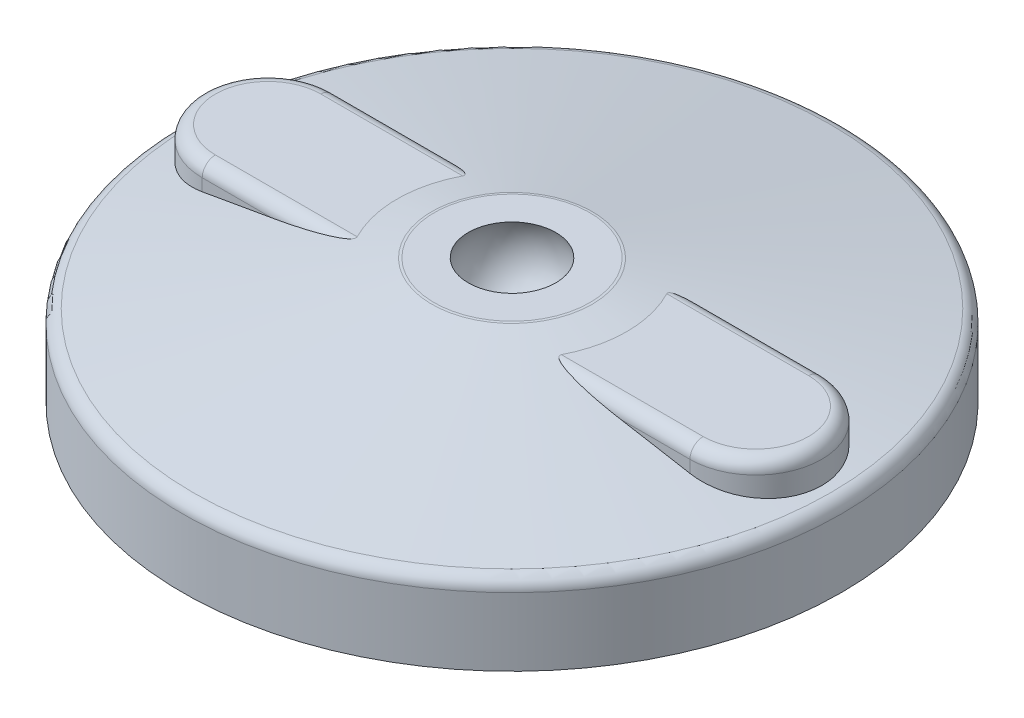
ISO-10303-21;
HEADER;
FILE_DESCRIPTION(('STEP AP214'),'2;1');
FILE_NAME('part.step','',(''),(''),'','','');
FILE_SCHEMA(('AUTOMOTIVE_DESIGN { 1 0 10303 214 1 1 1 1 }'));
ENDSEC;
DATA;
#1=APPLICATION_CONTEXT('core data for automotive mechanical design processes');
#2=APPLICATION_PROTOCOL_DEFINITION('international standard','automotive_design',2000,#1);
#3=PRODUCT_CONTEXT('',#1,'mechanical');
#4=PRODUCT('Part','Part','',(#3));
#5=PRODUCT_RELATED_PRODUCT_CATEGORY('part','',(#4));
#6=PRODUCT_DEFINITION_FORMATION('','',#4);
#7=PRODUCT_DEFINITION_CONTEXT('part definition',#1,'design');
#8=PRODUCT_DEFINITION('design','',#6,#7);
#9=PRODUCT_DEFINITION_SHAPE('','',#8);
#10=(LENGTH_UNIT() NAMED_UNIT(*) SI_UNIT(.MILLI.,.METRE.));
#11=(NAMED_UNIT(*) PLANE_ANGLE_UNIT() SI_UNIT($,.RADIAN.));
#12=(NAMED_UNIT(*) SI_UNIT($,.STERADIAN.) SOLID_ANGLE_UNIT());
#13=UNCERTAINTY_MEASURE_WITH_UNIT(LENGTH_MEASURE(1.E-05),#10,'distance_accuracy_value','');
#14=(GEOMETRIC_REPRESENTATION_CONTEXT(3) GLOBAL_UNCERTAINTY_ASSIGNED_CONTEXT((#13)) GLOBAL_UNIT_ASSIGNED_CONTEXT((#10,
#11,#12)) REPRESENTATION_CONTEXT('',''));
#15=CARTESIAN_POINT('',(0.,0.,0.));
#16=DIRECTION('',(0.,0.,1.));
#17=DIRECTION('',(1.,0.,0.));
#18=AXIS2_PLACEMENT_3D('',#15,#16,#17);
#19=CARTESIAN_POINT('',(0.,15.5,0.));
#20=DIRECTION('',(0.,0.,1.));
#21=DIRECTION('',(1.,0.,0.));
#22=AXIS2_PLACEMENT_3D('',#19,#20,#21);
#23=SPHERICAL_SURFACE('',#22,7.5);
#24=CARTESIAN_POINT('',(0.,15.5,0.));
#25=DIRECTION('',(0.,1.,0.));
#26=DIRECTION('',(0.,0.,1.));
#27=AXIS2_PLACEMENT_3D('',#24,#25,#26);
#28=SPHERICAL_SURFACE('',#27,7.5);
#29=CARTESIAN_POINT('',(0.,19.,0.));
#30=DIRECTION('',(0.,1.,0.));
#31=DIRECTION('',(0.,0.,1.));
#32=AXIS2_PLACEMENT_3D('',#29,#30,#31);
#33=CIRCLE('',#32,6.6332495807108);
#34=CARTESIAN_POINT('',(0.,19.,6.6332495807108));
#35=VERTEX_POINT('',#34);
#36=EDGE_CURVE('E19',#35,#35,#33,.F.);
#37=ORIENTED_EDGE('',*,*,#36,.F.);
#38=EDGE_LOOP('',(#37));
#39=FACE_BOUND('',#38,.T.);
#40=ADVANCED_FACE('F16',(#39),#28,.F.);
#41=CARTESIAN_POINT('',(37.,16.,0.));
#42=DIRECTION('',(0.,-1.,0.));
#43=DIRECTION('',(0.,0.,-1.));
#44=AXIS2_PLACEMENT_3D('',#41,#42,#43);
#45=TOROIDAL_SURFACE('',#44,8.,2.);
#46=CARTESIAN_POINT('',(37.,16.,8.));
#47=DIRECTION('',(-1.,0.,0.));
#48=DIRECTION('',(0.,-1.,0.));
#49=AXIS2_PLACEMENT_3D('',#46,#47,#48);
#50=CIRCLE('',#49,2.);
#51=CARTESIAN_POINT('',(37.,16.,10.));
#52=VERTEX_POINT('',#51);
#53=CARTESIAN_POINT('',(37.,18.,8.));
#54=VERTEX_POINT('',#53);
#55=EDGE_CURVE('E129',#52,#54,#50,.T.);
#56=ORIENTED_EDGE('',*,*,#55,.F.);
#57=CARTESIAN_POINT('',(37.,16.,0.));
#58=DIRECTION('',(0.,1.,0.));
#59=DIRECTION('',(-1.,0.,0.));
#60=AXIS2_PLACEMENT_3D('',#57,#58,#59);
#61=CIRCLE('',#60,10.);
#62=CARTESIAN_POINT('',(37.,16.,-10.));
#63=VERTEX_POINT('',#62);
#64=EDGE_CURVE('E103',#63,#52,#61,.F.);
#65=ORIENTED_EDGE('',*,*,#64,.F.);
#66=CARTESIAN_POINT('',(37.,16.,-8.));
#67=DIRECTION('',(1.,0.,0.));
#68=DIRECTION('',(0.,1.,0.));
#69=AXIS2_PLACEMENT_3D('',#66,#67,#68);
#70=CIRCLE('',#69,2.);
#71=CARTESIAN_POINT('',(37.,18.,-8.));
#72=VERTEX_POINT('',#71);
#73=EDGE_CURVE('E117',#72,#63,#70,.F.);
#74=ORIENTED_EDGE('',*,*,#73,.F.);
#75=CARTESIAN_POINT('',(37.,18.,0.));
#76=DIRECTION('',(0.,-1.,0.));
#77=DIRECTION('',(0.,0.,-1.));
#78=AXIS2_PLACEMENT_3D('',#75,#76,#77);
#79=CIRCLE('',#78,8.);
#80=EDGE_CURVE('E328',#54,#72,#79,.F.);
#81=ORIENTED_EDGE('',*,*,#80,.F.);
#82=EDGE_LOOP('',(#56,#65,#74,#81));
#83=FACE_BOUND('',#82,.T.);
#84=ADVANCED_FACE('F128',(#83),#45,.T.);
#85=CARTESIAN_POINT('',(-37.,16.,0.));
#86=DIRECTION('',(0.,-1.,0.));
#87=DIRECTION('',(0.,0.,-1.));
#88=AXIS2_PLACEMENT_3D('',#85,#86,#87);
#89=TOROIDAL_SURFACE('',#88,8.,2.);
#90=CARTESIAN_POINT('',(-37.,16.,7.99999999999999));
#91=DIRECTION('',(-1.,0.,0.));
#92=DIRECTION('',(0.,0.,1.));
#93=AXIS2_PLACEMENT_3D('',#90,#91,#92);
#94=CIRCLE('',#93,2.);
#95=CARTESIAN_POINT('',(-37.,18.,7.99999999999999));
#96=VERTEX_POINT('',#95);
#97=CARTESIAN_POINT('',(-37.,16.,10.));
#98=VERTEX_POINT('',#97);
#99=EDGE_CURVE('E272',#96,#98,#94,.F.);
#100=ORIENTED_EDGE('',*,*,#99,.F.);
#101=CARTESIAN_POINT('',(-37.,18.,0.));
#102=DIRECTION('',(0.,-1.,0.));
#103=DIRECTION('',(0.,0.,1.));
#104=AXIS2_PLACEMENT_3D('',#101,#102,#103);
#105=CIRCLE('',#104,7.99999999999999);
#106=CARTESIAN_POINT('',(-37.,18.,-8.));
#107=VERTEX_POINT('',#106);
#108=EDGE_CURVE('E80',#107,#96,#105,.F.);
#109=ORIENTED_EDGE('',*,*,#108,.F.);
#110=CARTESIAN_POINT('',(-37.,16.,-8.));
#111=DIRECTION('',(1.,0.,0.));
#112=DIRECTION('',(0.,1.,0.));
#113=AXIS2_PLACEMENT_3D('',#110,#111,#112);
#114=CIRCLE('',#113,2.);
#115=CARTESIAN_POINT('',(-37.,16.,-10.));
#116=VERTEX_POINT('',#115);
#117=EDGE_CURVE('E368',#116,#107,#114,.T.);
#118=ORIENTED_EDGE('',*,*,#117,.F.);
#119=CARTESIAN_POINT('',(-37.,16.,0.));
#120=DIRECTION('',(0.,1.,0.));
#121=DIRECTION('',(-1.,0.,0.));
#122=AXIS2_PLACEMENT_3D('',#119,#120,#121);
#123=CIRCLE('',#122,10.);
#124=EDGE_CURVE('E116',#98,#116,#123,.F.);
#125=ORIENTED_EDGE('',*,*,#124,.F.);
#126=EDGE_LOOP('',(#100,#109,#118,#125));
#127=FACE_BOUND('',#126,.T.);
#128=ADVANCED_FACE('F359',(#127),#89,.T.);
#129=CARTESIAN_POINT('',(9.2252879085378,19.,0.));
#130=DIRECTION('',(0.,1.,0.));
#131=DIRECTION('',(0.,0.,1.));
#132=AXIS2_PLACEMENT_3D('',#129,#130,#131);
#133=PLANE('',#132);
#134=ORIENTED_EDGE('',*,*,#36,.T.);
#135=EDGE_LOOP('',(#134));
#136=FACE_BOUND('',#135,.T.);
#137=CARTESIAN_POINT('',(0.,19.,0.));
#138=DIRECTION('',(0.,-1.,0.));
#139=DIRECTION('',(1.,0.,0.));
#140=AXIS2_PLACEMENT_3D('',#137,#138,#139);
#141=CIRCLE('',#140,11.8173262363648);
#142=CARTESIAN_POINT('',(11.8173262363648,19.,0.));
#143=VERTEX_POINT('',#142);
#144=EDGE_CURVE('E259',#143,#143,#141,.T.);
#145=ORIENTED_EDGE('',*,*,#144,.F.);
#146=EDGE_LOOP('',(#145));
#147=FACE_BOUND('',#146,.T.);
#148=ADVANCED_FACE('F253',(#136,#147),#133,.T.);
#149=CARTESIAN_POINT('',(12.,5.,-10.));
#150=DIRECTION('',(0.,0.,-1.));
#151=DIRECTION('',(-1.,0.,0.));
#152=AXIS2_PLACEMENT_3D('',#149,#150,#151);
#153=PLANE('',#152);
#154=DIRECTION('',(0.,1.,0.));
#155=VECTOR('',#154,1.);
#156=CARTESIAN_POINT('',(37.,5.,-10.));
#157=LINE('',#156,#155);
#158=CARTESIAN_POINT('',(36.999999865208,14.1501907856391,-10.));
#159=VERTEX_POINT('',#158);
#160=EDGE_CURVE('E107',#159,#63,#157,.T.);
#161=ORIENTED_EDGE('',*,*,#160,.F.);
#162=CARTESIAN_POINT('',(26.459055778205,16.0000000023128,-9.99999999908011));
#163=CARTESIAN_POINT('',(27.337937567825,15.8485359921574,-9.99999999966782));
#164=CARTESIAN_POINT('',(28.2166677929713,15.6961960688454,-9.99999999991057));
#165=CARTESIAN_POINT('',(29.9738775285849,15.3900854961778,-10.0000000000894));
#166=CARTESIAN_POINT('',(30.852357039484,15.2363148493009,-10.0000000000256));
#167=CARTESIAN_POINT('',(32.6091201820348,14.9276635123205,-9.99999999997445));
#168=CARTESIAN_POINT('',(33.4874038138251,14.7727828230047,-9.99999999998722));
#169=CARTESIAN_POINT('',(35.2438123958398,14.4621152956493,-10.0000000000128));
#170=CARTESIAN_POINT('',(36.1219373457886,14.3063284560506,-10.0000000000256));
#171=CARTESIAN_POINT('',(36.999999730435,14.1501908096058,-10.));
#172=B_SPLINE_CURVE_WITH_KNOTS('',3,(#162,#163,#164,#165,#166,#167,#168,#169,#170,#171),
.UNSPECIFIED.,.F.,.F.,(4,2,2,2,4),(0.,2.67551190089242,5.35101916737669,8.02652453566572,
10.7020345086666),.UNSPECIFIED.);
#173=CARTESIAN_POINT('',(26.4590557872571,16.,-10.));
#174=VERTEX_POINT('',#173);
#175=EDGE_CURVE('E115',#174,#159,#172,.T.);
#176=ORIENTED_EDGE('',*,*,#175,.F.);
#177=DIRECTION('',(1.,0.,0.));
#178=VECTOR('',#177,1.);
#179=CARTESIAN_POINT('',(19.8425477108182,16.,-10.));
#180=LINE('',#179,#178);
#181=EDGE_CURVE('E71',#63,#174,#180,.F.);
#182=ORIENTED_EDGE('',*,*,#181,.F.);
#183=EDGE_LOOP('',(#161,#176,#182));
#184=FACE_BOUND('',#183,.T.);
#185=ADVANCED_FACE('F114',(#184),#153,.T.);
#186=CARTESIAN_POINT('',(37.,5.,0.));
#187=DIRECTION('',(0.,1.,0.));
#188=DIRECTION('',(-1.,0.,0.));
#189=AXIS2_PLACEMENT_3D('',#186,#187,#188);
#190=CYLINDRICAL_SURFACE('',#189,10.);
#191=CARTESIAN_POINT('',(36.9999997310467,14.1501908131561,-10.0000000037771));
#192=CARTESIAN_POINT('',(37.2831759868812,14.09982997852,-10.0000289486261));
#193=CARTESIAN_POINT('',(37.5664469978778,14.0499981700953,-9.98797278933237));
#194=CARTESIAN_POINT('',(38.131174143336,13.9516550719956,-9.93984902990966));
#195=CARTESIAN_POINT('',(38.412630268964,13.9031437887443,-9.90378131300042));
#196=CARTESIAN_POINT('',(38.9716574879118,13.8077154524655,-9.80780402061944));
#197=CARTESIAN_POINT('',(39.2492294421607,13.7607980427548,-9.7478998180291));
#198=CARTESIAN_POINT('',(39.7985498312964,13.6687866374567,-9.60461744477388));
#199=CARTESIAN_POINT('',(40.0702984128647,13.6236925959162,-9.52123986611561));
#200=CARTESIAN_POINT('',(40.6062070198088,13.5355175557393,-9.33145954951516));
#201=CARTESIAN_POINT('',(40.8703612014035,13.4924380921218,-9.22503959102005));
#202=CARTESIAN_POINT('',(41.3889248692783,13.4085367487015,-8.9899046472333));
#203=CARTESIAN_POINT('',(41.6433344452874,13.3677148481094,-8.86118986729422));
#204=CARTESIAN_POINT('',(42.1404392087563,13.288534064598,-8.58236977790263));
#205=CARTESIAN_POINT('',(42.3831382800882,13.2501743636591,-8.43227162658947));
#206=CARTESIAN_POINT('',(42.855090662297,13.1760808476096,-8.11167621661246));
#207=CARTESIAN_POINT('',(43.08434414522,13.1403469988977,-7.94117921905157));
#208=CARTESIAN_POINT('',(43.5257868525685,13.0719593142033,-7.58249953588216));
#209=CARTESIAN_POINT('',(43.7381044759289,13.0392818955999,-7.39447936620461));
#210=CARTESIAN_POINT('',(44.1462202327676,12.9768122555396,-7.00085068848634));
#211=CARTESIAN_POINT('',(44.3420184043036,12.9470200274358,-6.79524222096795));
#212=CARTESIAN_POINT('',(44.715633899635,12.8904472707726,-6.36785418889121));
#213=CARTESIAN_POINT('',(44.8934487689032,12.8636671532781,-6.14607242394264));
#214=CARTESIAN_POINT('',(45.229704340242,12.8132396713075,-5.68794353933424));
#215=CARTESIAN_POINT('',(45.3881452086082,12.7895922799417,-5.45159654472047));
#216=CARTESIAN_POINT('',(45.6826789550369,12.7457926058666,-4.96891081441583));
#217=CARTESIAN_POINT('',(45.8190137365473,12.7256023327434,-4.72272310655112));
#218=CARTESIAN_POINT('',(46.0705356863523,12.6884651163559,-4.21953731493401));
#219=CARTESIAN_POINT('',(46.1857230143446,12.6715181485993,-3.96253931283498));
#220=CARTESIAN_POINT('',(46.3940588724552,12.6409400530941,-3.43960260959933));
#221=CARTESIAN_POINT('',(46.4872098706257,12.6273085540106,-3.17366491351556));
#222=CARTESIAN_POINT('',(46.6507744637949,12.6034158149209,-2.63473896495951));
#223=CARTESIAN_POINT('',(46.7211881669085,12.5931545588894,-2.36175074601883));
#224=CARTESIAN_POINT('',(46.8382187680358,12.5761202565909,-1.81312727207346));
#225=CARTESIAN_POINT('',(46.885039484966,12.5693173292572,-1.53753640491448));
#226=CARTESIAN_POINT('',(46.9554537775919,12.5590924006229,-0.98334183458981));
#227=CARTESIAN_POINT('',(46.9790475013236,12.5556703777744,-0.704738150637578));
#228=CARTESIAN_POINT('',(47.0028285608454,12.5522212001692,-0.146513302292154));
#229=CARTESIAN_POINT('',(47.0030159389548,12.5521940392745,0.133107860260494));
#230=CARTESIAN_POINT('',(46.9799829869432,12.5555346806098,0.691364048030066));
#231=CARTESIAN_POINT('',(46.9567626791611,12.5589024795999,0.969999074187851));
#232=CARTESIAN_POINT('',(46.8872249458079,12.5689998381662,1.52322299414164));
#233=CARTESIAN_POINT('',(46.8409964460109,12.5757164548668,1.79782330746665));
#234=CARTESIAN_POINT('',(46.7258351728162,12.5924776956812,2.34211635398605));
#235=CARTESIAN_POINT('',(46.6569024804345,12.6025223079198,2.61180910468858));
#236=CARTESIAN_POINT('',(46.4968513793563,12.6258986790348,3.14438000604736));
#237=CARTESIAN_POINT('',(46.4057331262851,12.6392304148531,3.40725820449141));
#238=CARTESIAN_POINT('',(46.2019925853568,12.6691268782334,3.92435443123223));
#239=CARTESIAN_POINT('',(46.0893702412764,12.6856916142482,4.17857243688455));
#240=CARTESIAN_POINT('',(45.8432197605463,12.7220220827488,4.67705945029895));
#241=CARTESIAN_POINT('',(45.7096511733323,12.7417940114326,4.92130803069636));
#242=CARTESIAN_POINT('',(45.4227608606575,12.7844345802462,5.39762882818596));
#243=CARTESIAN_POINT('',(45.2694391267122,12.8073032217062,5.62970104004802));
#244=CARTESIAN_POINT('',(44.944179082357,12.8560422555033,6.08006345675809));
#245=CARTESIAN_POINT('',(44.7722413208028,12.8819125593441,6.29835406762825));
#246=CARTESIAN_POINT('',(44.4110049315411,12.9365482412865,6.71967317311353));
#247=CARTESIAN_POINT('',(44.2217062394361,12.9653136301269,6.92270161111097));
#248=CARTESIAN_POINT('',(43.8257233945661,13.0258332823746,7.31351012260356));
#249=CARTESIAN_POINT('',(43.6189255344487,13.05760728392,7.50117192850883));
#250=CARTESIAN_POINT('',(43.190619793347,13.1238348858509,7.85837065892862));
#251=CARTESIAN_POINT('',(42.969111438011,13.1582885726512,8.02790699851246));
#252=CARTESIAN_POINT('',(42.5129148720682,13.2297377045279,8.34777838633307));
#253=CARTESIAN_POINT('',(42.2782222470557,13.2667340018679,8.49810694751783));
#254=CARTESIAN_POINT('',(41.7974129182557,13.3430943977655,8.77851239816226));
#255=CARTESIAN_POINT('',(41.551296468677,13.3824584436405,8.90858973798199));
#256=CARTESIAN_POINT('',(41.0464829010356,13.4638459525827,9.14904577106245));
#257=CARTESIAN_POINT('',(40.7876734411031,13.5058948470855,9.25918002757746));
#258=CARTESIAN_POINT('',(40.2620064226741,13.5920387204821,9.45717682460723));
#259=CARTESIAN_POINT('',(39.9951489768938,13.6361336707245,9.54503967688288));
#260=CARTESIAN_POINT('',(39.4555995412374,13.7261046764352,9.69786396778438));
#261=CARTESIAN_POINT('',(39.1829146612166,13.7719786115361,9.76285179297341));
#262=CARTESIAN_POINT('',(38.6334242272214,13.8653119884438,9.86966097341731));
#263=CARTESIAN_POINT('',(38.356620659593,13.912770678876,9.91149314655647));
#264=CARTESIAN_POINT('',(37.8993738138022,13.991959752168,9.96110861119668));
#265=CARTESIAN_POINT('',(37.7195737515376,14.0232986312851,9.97570591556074));
#266=CARTESIAN_POINT('',(37.3598422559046,14.0864174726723,9.99514437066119));
#267=CARTESIAN_POINT('',(37.1799115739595,14.118196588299,10.0000021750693));
#268=CARTESIAN_POINT('',(36.99999999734,14.150190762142,10.));
#269=B_SPLINE_CURVE_WITH_KNOTS('',3,(#191,#192,#193,#194,#195,#196,#197,#198,#199,#200,#201,
#202,#203,#204,#205,#206,#207,#208,#209,#210,#211,#212,#213,#214,#215,#216,#217,#218,#219,#220,
#221,#222,#223,#224,#225,#226,#227,#228,#229,#230,#231,#232,#233,#234,#235,#236,#237,#238,#239,
#240,#241,#242,#243,#244,#245,#246,#247,#248,#249,#250,#251,#252,#253,#254,#255,#256,#257,#258,
#259,#260,#261,#262,#263,#264,#265,#266,#267,#268),.UNSPECIFIED.,.F.,.F.,(4,2,2,2,2,2,2,2,2,2,2,
2,2,2,2,2,2,2,2,2,2,2,2,2,2,2,2,2,2,2,2,2,2,2,2,2,2,2,4),(0.,0.862606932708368,1.72521806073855,
2.58763486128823,3.45002991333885,4.31307170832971,5.17610555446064,6.03885117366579,
6.90158575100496,7.75699256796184,8.61239741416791,9.46791885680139,10.3234329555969,
11.1688401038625,12.0142408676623,12.8595469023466,13.7048489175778,14.5427175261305,
15.380580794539,16.2184425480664,17.0563035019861,17.8909510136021,18.7255955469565,
19.5602342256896,20.3948750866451,21.2311480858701,22.0674214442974,22.9036701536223,
23.7399219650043,24.5821005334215,25.4243062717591,26.2667957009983,27.1092663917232,
27.9614514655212,28.8136246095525,29.6648115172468,30.5156004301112,31.0646402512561,
31.6127404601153),.UNSPECIFIED.);
#270=CARTESIAN_POINT('',(36.9999999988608,14.1501907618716,10.));
#271=VERTEX_POINT('',#270);
#272=EDGE_CURVE('E109',#159,#271,#269,.T.);
#273=ORIENTED_EDGE('',*,*,#272,.F.);
#274=ORIENTED_EDGE('',*,*,#160,.T.);
#275=ORIENTED_EDGE('',*,*,#64,.T.);
#276=DIRECTION('',(0.,1.,0.));
#277=VECTOR('',#276,1.);
#278=CARTESIAN_POINT('',(37.,5.,10.));
#279=LINE('',#278,#277);
#280=EDGE_CURVE('E112',#271,#52,#279,.T.);
#281=ORIENTED_EDGE('',*,*,#280,.F.);
#282=EDGE_LOOP('',(#273,#274,#275,#281));
#283=FACE_BOUND('',#282,.T.);
#284=ADVANCED_FACE('F108',(#283),#190,.T.);
#285=CARTESIAN_POINT('',(37.,5.,10.));
#286=DIRECTION('',(0.,0.,1.));
#287=DIRECTION('',(1.,0.,0.));
#288=AXIS2_PLACEMENT_3D('',#285,#286,#287);
#289=PLANE('',#288);
#290=CARTESIAN_POINT('',(36.9999999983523,14.1501907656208,10.0000000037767));
#291=CARTESIAN_POINT('',(36.12193759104,14.3063284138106,10.0000000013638));
#292=CARTESIAN_POINT('',(35.2438126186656,14.4621152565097,10.0000000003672));
#293=CARTESIAN_POINT('',(33.4874039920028,14.772782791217,9.99999999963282));
#294=CARTESIAN_POINT('',(32.6091203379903,14.9276634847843,9.99999999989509));
#295=CARTESIAN_POINT('',(30.8523571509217,15.2363148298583,10.0000000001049));
#296=CARTESIAN_POINT('',(29.9738776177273,15.3900854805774,10.0000000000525));
#297=CARTESIAN_POINT('',(28.2166678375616,15.6961960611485,9.99999999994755));
#298=CARTESIAN_POINT('',(27.3379375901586,15.8485359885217,9.99999999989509));
#299=CARTESIAN_POINT('',(26.4590557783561,16.0000000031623,10.));
#300=B_SPLINE_CURVE_WITH_KNOTS('',3,(#290,#291,#292,#293,#294,#295,#296,#297,#298,#299),
.UNSPECIFIED.,.F.,.F.,(4,2,2,2,4),(0.,2.67551004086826,5.35101547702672,8.02652281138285,
10.7020347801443),.UNSPECIFIED.);
#301=CARTESIAN_POINT('',(26.459055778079,16.0000000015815,10.));
#302=VERTEX_POINT('',#301);
#303=EDGE_CURVE('E235',#271,#302,#300,.T.);
#304=ORIENTED_EDGE('',*,*,#303,.F.);
#305=ORIENTED_EDGE('',*,*,#280,.T.);
#306=DIRECTION('',(-1.,0.,0.));
#307=VECTOR('',#306,1.);
#308=CARTESIAN_POINT('',(32.3425477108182,16.,10.));
#309=LINE('',#308,#307);
#310=EDGE_CURVE('E331',#302,#52,#309,.F.);
#311=ORIENTED_EDGE('',*,*,#310,.F.);
#312=EDGE_LOOP('',(#304,#305,#311));
#313=FACE_BOUND('',#312,.T.);
#314=ADVANCED_FACE('F240',(#313),#289,.T.);
#315=CARTESIAN_POINT('',(32.3425477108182,16.,8.));
#316=DIRECTION('',(-1.,0.,0.));
#317=DIRECTION('',(0.,-1.,0.));
#318=AXIS2_PLACEMENT_3D('',#315,#316,#317);
#319=CYLINDRICAL_SURFACE('',#318,2.);
#320=ORIENTED_EDGE('',*,*,#55,.T.);
#321=DIRECTION('',(1.,0.,0.));
#322=VECTOR('',#321,1.);
#323=CARTESIAN_POINT('',(27.6850954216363,18.,8.));
#324=LINE('',#323,#322);
#325=CARTESIAN_POINT('',(15.4840273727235,18.0000000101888,8.0000000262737));
#326=VERTEX_POINT('',#325);
#327=EDGE_CURVE('E320',#326,#54,#324,.T.);
#328=ORIENTED_EDGE('',*,*,#327,.F.);
#329=CARTESIAN_POINT('',(26.459055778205,16.0000000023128,9.99999999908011));
#330=CARTESIAN_POINT('',(26.1304577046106,16.0566235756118,9.99998042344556));
#331=CARTESIAN_POINT('',(25.8018616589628,16.113268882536,9.99759453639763));
#332=CARTESIAN_POINT('',(25.1447303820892,16.2266082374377,9.98793975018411));
#333=CARTESIAN_POINT('',(24.8161951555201,16.2833022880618,9.98067056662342));
#334=CARTESIAN_POINT('',(24.1591238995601,16.3967648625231,9.96109409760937));
#335=CARTESIAN_POINT('',(23.8305879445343,16.4535334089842,9.94878441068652));
#336=CARTESIAN_POINT('',(23.1737810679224,16.56712806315,9.91880529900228));
#337=CARTESIAN_POINT('',(22.8455101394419,16.6239541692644,9.9011360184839));
#338=CARTESIAN_POINT('',(22.0828553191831,16.7561439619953,9.8532917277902));
#339=CARTESIAN_POINT('',(21.6486085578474,16.8315386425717,9.82091915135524));
#340=CARTESIAN_POINT('',(20.9981020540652,16.9448040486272,9.76327191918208));
#341=CARTESIAN_POINT('',(20.7814195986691,16.9825864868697,9.74254251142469));
#342=CARTESIAN_POINT('',(20.348423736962,17.0582317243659,9.69766984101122));
#343=CARTESIAN_POINT('',(20.132110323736,17.0960945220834,9.67352664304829));
#344=CARTESIAN_POINT('',(19.6432893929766,17.1818748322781,9.61448242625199));
#345=CARTESIAN_POINT('',(19.3709261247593,17.2298244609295,9.5784207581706));
#346=CARTESIAN_POINT('',(18.8273704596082,17.3259746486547,9.49857305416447));
#347=CARTESIAN_POINT('',(18.556177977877,17.3741751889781,9.4547875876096));
#348=CARTESIAN_POINT('',(18.1128102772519,17.4535746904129,9.37442776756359));
#349=CARTESIAN_POINT('',(17.9400619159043,17.4846609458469,9.3409134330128));
#350=CARTESIAN_POINT('',(17.5957236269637,17.5470457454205,9.26844559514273));
#351=CARTESIAN_POINT('',(17.4241336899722,17.5783442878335,9.22949213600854));
#352=CARTESIAN_POINT('',(17.1421025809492,17.6303044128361,9.15900571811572));
#353=CARTESIAN_POINT('',(17.031118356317,17.6508856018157,9.12959313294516));
#354=CARTESIAN_POINT('',(16.8103344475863,17.6921902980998,9.0667318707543));
#355=CARTESIAN_POINT('',(16.7005344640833,17.7129137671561,9.03328424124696));
#356=CARTESIAN_POINT('',(16.5188375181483,17.7476393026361,8.97289834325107));
#357=CARTESIAN_POINT('',(16.4464307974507,17.7615943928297,8.94747288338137));
#358=CARTESIAN_POINT('',(16.3028171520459,17.7895832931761,8.89348801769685));
#359=CARTESIAN_POINT('',(16.2316098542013,17.8036170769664,8.86492960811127));
#360=CARTESIAN_POINT('',(16.0939954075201,17.8311636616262,8.80491200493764));
#361=CARTESIAN_POINT('',(16.0275125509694,17.844673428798,8.77362630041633));
#362=CARTESIAN_POINT('',(15.8972590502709,17.8717307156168,8.70567766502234));
#363=CARTESIAN_POINT('',(15.8334875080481,17.8852782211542,8.66901653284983));
#364=CARTESIAN_POINT('',(15.7365118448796,17.9066667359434,8.60435706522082));
#365=CARTESIAN_POINT('',(15.7015553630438,17.9145550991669,8.57902890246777));
#366=CARTESIAN_POINT('',(15.6346231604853,17.9301809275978,8.5246036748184));
#367=CARTESIAN_POINT('',(15.6026431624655,17.937918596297,8.49551216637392));
#368=CARTESIAN_POINT('',(15.5550222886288,17.9501323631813,8.44428320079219));
#369=CARTESIAN_POINT('',(15.5377795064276,17.954734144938,8.42368312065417));
#370=CARTESIAN_POINT('',(15.5062713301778,17.9636490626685,8.38022796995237));
#371=CARTESIAN_POINT('',(15.492002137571,17.9679625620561,8.35737583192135));
#372=CARTESIAN_POINT('',(15.4708168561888,17.9750705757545,8.31532537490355));
#373=CARTESIAN_POINT('',(15.4629546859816,17.9779762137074,8.29662995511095));
#374=CARTESIAN_POINT('',(15.4503873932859,17.9833617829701,8.25816846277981));
#375=CARTESIAN_POINT('',(15.4456744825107,17.9858427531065,8.23840516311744));
#376=CARTESIAN_POINT('',(15.439912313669,17.9902640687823,8.19814328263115));
#377=CARTESIAN_POINT('',(15.4388870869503,17.9922007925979,8.17764075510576));
#378=CARTESIAN_POINT('',(15.440698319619,17.9954292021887,8.13669510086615));
#379=CARTESIAN_POINT('',(15.4435466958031,17.9967188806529,8.11625235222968));
#380=CARTESIAN_POINT('',(15.4519672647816,17.9984922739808,8.07944649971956));
#381=CARTESIAN_POINT('',(15.4570189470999,17.9990731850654,8.0629621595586));
#382=CARTESIAN_POINT('',(15.4691258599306,17.9998269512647,8.03083383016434));
#383=CARTESIAN_POINT('',(15.4761698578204,18.0000020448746,8.01518569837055));
#384=CARTESIAN_POINT('',(15.4840274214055,18.,8.0000000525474));
#385=B_SPLINE_CURVE_WITH_KNOTS('',3,(#329,#330,#331,#332,#333,#334,#335,#336,#337,#338,#339,
#340,#341,#342,#343,#344,#345,#346,#347,#348,#349,#350,#351,#352,#353,#354,#355,#356,#357,#358,
#359,#360,#361,#362,#363,#364,#365,#366,#367,#368,#369,#370,#371,#372,#373,#374,#375,#376,#377,
#378,#379,#380,#381,#382,#383,#384),.UNSPECIFIED.,.F.,.F.,(4,2,2,2,2,2,2,2,2,2,2,2,2,2,2,2,2,2,
2,2,2,2,2,2,2,2,2,4),(0.,1.00031710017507,2.0006924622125,3.00154499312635,4.00237059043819,
5.32799943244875,5.9907580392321,6.65350408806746,7.49010370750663,8.32664168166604,
8.86266600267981,9.39868596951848,9.74857206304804,10.0983675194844,10.3323169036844,
10.5661921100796,10.7901881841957,11.014109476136,11.1456066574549,11.2769118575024,
11.3585026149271,11.4399884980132,11.5012282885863,11.5623160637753,11.6238012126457,
11.6854759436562,11.7370833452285,11.7884053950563),.UNSPECIFIED.);
#386=EDGE_CURVE('E230',#302,#326,#385,.T.);
#387=ORIENTED_EDGE('',*,*,#386,.F.);
#388=ORIENTED_EDGE('',*,*,#310,.T.);
#389=EDGE_LOOP('',(#320,#328,#387,#388));
#390=FACE_BOUND('',#389,.T.);
#391=ADVANCED_FACE('F243',(#390),#319,.T.);
#392=CARTESIAN_POINT('',(27.6850954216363,18.,0.));
#393=DIRECTION('',(0.,1.,0.));
#394=DIRECTION('',(0.,0.,1.));
#395=AXIS2_PLACEMENT_3D('',#392,#393,#394);
#396=PLANE('',#395);
#397=DIRECTION('',(1.,0.,0.));
#398=VECTOR('',#397,1.);
#399=CARTESIAN_POINT('',(19.8425477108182,18.,-8.));
#400=LINE('',#399,#398);
#401=CARTESIAN_POINT('',(15.4840273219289,18.0000000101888,-8.));
#402=VERTEX_POINT('',#401);
#403=EDGE_CURVE('E123',#402,#72,#400,.T.);
#404=ORIENTED_EDGE('',*,*,#403,.F.);
#405=CARTESIAN_POINT('',(0.,18.0000000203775,0.));
#406=DIRECTION('',(0.,-1.,0.));
#407=DIRECTION('',(1.,0.,0.));
#408=AXIS2_PLACEMENT_3D('',#405,#406,#407);
#409=CIRCLE('',#408,17.4285714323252);
#410=EDGE_CURVE('E396',#326,#402,#409,.F.);
#411=ORIENTED_EDGE('',*,*,#410,.F.);
#412=ORIENTED_EDGE('',*,*,#327,.T.);
#413=ORIENTED_EDGE('',*,*,#80,.T.);
#414=EDGE_LOOP('',(#404,#411,#412,#413));
#415=FACE_BOUND('',#414,.T.);
#416=ADVANCED_FACE('F310',(#415),#396,.T.);
#417=CARTESIAN_POINT('',(19.8425477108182,16.,-8.));
#418=DIRECTION('',(1.,0.,0.));
#419=DIRECTION('',(0.,1.,0.));
#420=AXIS2_PLACEMENT_3D('',#417,#418,#419);
#421=CYLINDRICAL_SURFACE('',#420,2.);
#422=ORIENTED_EDGE('',*,*,#73,.T.);
#423=ORIENTED_EDGE('',*,*,#181,.T.);
#424=CARTESIAN_POINT('',(15.4840274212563,17.9999999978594,-8.00000005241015));
#425=CARTESIAN_POINT('',(15.474779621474,18.0000059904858,-8.01783159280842));
#426=CARTESIAN_POINT('',(15.4666691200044,17.9997616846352,-8.03633996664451));
#427=CARTESIAN_POINT('',(15.4533031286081,17.998704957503,-8.07440511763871));
#428=CARTESIAN_POINT('',(15.4480576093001,17.9978905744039,-8.09396529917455));
#429=CARTESIAN_POINT('',(15.4410480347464,17.9956166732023,-8.13385015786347));
#430=CARTESIAN_POINT('',(15.4393105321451,17.9941523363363,-8.1541794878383));
#431=CARTESIAN_POINT('',(15.4396524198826,17.9906048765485,-8.19469005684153));
#432=CARTESIAN_POINT('',(15.4417207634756,17.9885235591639,-8.21487155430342));
#433=CARTESIAN_POINT('',(15.4490481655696,17.9840521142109,-8.25272368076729));
#434=CARTESIAN_POINT('',(15.4540107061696,17.9817052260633,-8.27045906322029));
#435=CARTESIAN_POINT('',(15.4664211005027,17.9766840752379,-8.30500087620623));
#436=CARTESIAN_POINT('',(15.473873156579,17.9740092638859,-8.32180567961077));
#437=CARTESIAN_POINT('',(15.4966917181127,17.9664668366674,-8.36578745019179));
#438=CARTESIAN_POINT('',(15.513937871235,17.9613804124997,-8.39194405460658));
#439=CARTESIAN_POINT('',(15.5521060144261,17.9508649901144,-8.44132416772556));
#440=CARTESIAN_POINT('',(15.5730391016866,17.9454349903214,-8.46453844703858));
#441=CARTESIAN_POINT('',(15.6233187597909,17.93289784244,-8.514529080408));
#442=CARTESIAN_POINT('',(15.6534001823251,17.9257383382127,-8.54054199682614));
#443=CARTESIAN_POINT('',(15.7159270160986,17.9113019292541,-8.58955621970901));
#444=CARTESIAN_POINT('',(15.748376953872,17.9040248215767,-8.61255151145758));
#445=CARTESIAN_POINT('',(15.8149850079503,17.8893925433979,-8.65630021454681));
#446=CARTESIAN_POINT('',(15.8491515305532,17.8820371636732,-8.67704061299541));
#447=CARTESIAN_POINT('',(15.9185182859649,17.8673287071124,-8.71660768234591));
#448=CARTESIAN_POINT('',(15.9537175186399,17.8599756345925,-8.73543613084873));
#449=CARTESIAN_POINT('',(16.0556707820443,17.8389221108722,-8.78720915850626));
#450=CARTESIAN_POINT('',(16.1233790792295,17.8252337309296,-8.81827395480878));
#451=CARTESIAN_POINT('',(16.2604265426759,17.7979244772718,-8.87663742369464));
#452=CARTESIAN_POINT('',(16.3297667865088,17.7843036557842,-8.90393352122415));
#453=CARTESIAN_POINT('',(16.5396720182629,17.7434961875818,-8.98167712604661));
#454=CARTESIAN_POINT('',(16.6818356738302,17.7164224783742,-9.02784680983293));
#455=CARTESIAN_POINT('',(16.9685626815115,17.6624924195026,-9.11293201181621));
#456=CARTESIAN_POINT('',(17.1131300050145,17.6356365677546,-9.15183387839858));
#457=CARTESIAN_POINT('',(17.4034195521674,17.5821663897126,-9.2242435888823));
#458=CARTESIAN_POINT('',(17.549139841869,17.5555517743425,-9.25775902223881));
#459=CARTESIAN_POINT('',(17.8401903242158,17.5027156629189,-9.32041872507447));
#460=CARTESIAN_POINT('',(17.9855126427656,17.4764927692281,-9.34959890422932));
#461=CARTESIAN_POINT('',(18.2767991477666,17.4241688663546,-9.40469993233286));
#462=CARTESIAN_POINT('',(18.4227633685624,17.3980678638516,-9.43062060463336));
#463=CARTESIAN_POINT('',(18.8614355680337,17.3198956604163,-9.5043384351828));
#464=CARTESIAN_POINT('',(19.1548514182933,17.2679682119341,-9.54807661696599));
#465=CARTESIAN_POINT('',(19.7432354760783,17.1642856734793,-9.62747702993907));
#466=CARTESIAN_POINT('',(20.0382053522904,17.1125309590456,-9.66312704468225));
#467=CARTESIAN_POINT('',(20.6288527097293,17.009194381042,-9.72778457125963));
#468=CARTESIAN_POINT('',(20.924530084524,16.95761249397,-9.75679302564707));
#469=CARTESIAN_POINT('',(21.5159761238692,16.8546342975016,-9.809123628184));
#470=CARTESIAN_POINT('',(21.811744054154,16.803237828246,-9.83245384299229));
#471=CARTESIAN_POINT('',(22.4036500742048,16.7005216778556,-9.87412238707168));
#472=CARTESIAN_POINT('',(22.6997881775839,16.6492019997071,-9.89246052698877));
#473=CARTESIAN_POINT('',(23.5881745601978,16.4953960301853,-9.940660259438));
#474=CARTESIAN_POINT('',(24.1808202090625,16.3929888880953,-9.96374329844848));
#475=CARTESIAN_POINT('',(24.9141103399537,16.2664129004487,-9.98232625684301));
#476=CARTESIAN_POINT('',(25.0545890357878,16.2421704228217,-9.98543348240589));
#477=CARTESIAN_POINT('',(25.3355764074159,16.1936918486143,-9.99074861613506));
#478=CARTESIAN_POINT('',(25.476085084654,16.1694557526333,-9.99295645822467));
#479=CARTESIAN_POINT('',(25.7570057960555,16.1210105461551,-9.99648326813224));
#480=CARTESIAN_POINT('',(25.8974178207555,16.0968014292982,-9.99780292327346));
#481=CARTESIAN_POINT('',(26.178238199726,16.0483934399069,-9.99956101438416));
#482=CARTESIAN_POINT('',(26.3186465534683,16.0241945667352,-9.99999951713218));
#483=CARTESIAN_POINT('',(26.4590557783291,16.0000000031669,-10.0000000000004));
#484=B_SPLINE_CURVE_WITH_KNOTS('',3,(#424,#425,#426,#427,#428,#429,#430,#431,#432,#433,#434,
#435,#436,#437,#438,#439,#440,#441,#442,#443,#444,#445,#446,#447,#448,#449,#450,#451,#452,#453,
#454,#455,#456,#457,#458,#459,#460,#461,#462,#463,#464,#465,#466,#467,#468,#469,#470,#471,#472,
#473,#474,#475,#476,#477,#478,#479,#480,#481,#482,#483),.UNSPECIFIED.,.F.,.F.,(4,2,2,2,2,2,2,2,
2,2,2,2,2,2,2,2,2,2,2,2,2,2,2,2,2,2,2,2,2,4),(0.,0.0603364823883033,0.120881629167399,
0.181883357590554,0.242708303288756,0.29818548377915,0.353756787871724,0.448423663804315,
0.543380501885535,0.664320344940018,0.785497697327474,0.90734089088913,1.02906974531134,
1.25610935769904,1.48330334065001,1.93864984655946,2.39484324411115,2.85038812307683,
3.30191952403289,3.75347538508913,4.65680989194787,5.56149985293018,6.46606134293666,
7.3693301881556,8.27263329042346,10.0779404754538,10.5057074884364,10.9335059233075,
11.3609729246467,11.788407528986),.UNSPECIFIED.);
#485=EDGE_CURVE('E223',#402,#174,#484,.T.);
#486=ORIENTED_EDGE('',*,*,#485,.F.);
#487=ORIENTED_EDGE('',*,*,#403,.T.);
#488=EDGE_LOOP('',(#422,#423,#486,#487));
#489=FACE_BOUND('',#488,.T.);
#490=ADVANCED_FACE('F121',(#489),#421,.T.);
#491=CARTESIAN_POINT('',(-12.,4.99999999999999,10.));
#492=DIRECTION('',(0.,0.,1.));
#493=DIRECTION('',(1.,0.,0.));
#494=AXIS2_PLACEMENT_3D('',#491,#492,#493);
#495=PLANE('',#494);
#496=DIRECTION('',(0.,1.,0.));
#497=VECTOR('',#496,1.);
#498=CARTESIAN_POINT('',(-37.,4.99999999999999,10.));
#499=LINE('',#498,#497);
#500=CARTESIAN_POINT('',(-36.999999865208,14.1501907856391,10.));
#501=VERTEX_POINT('',#500);
#502=EDGE_CURVE('E378',#501,#98,#499,.T.);
#503=ORIENTED_EDGE('',*,*,#502,.F.);
#504=CARTESIAN_POINT('',(-26.459055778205,16.0000000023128,9.9999999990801));
#505=CARTESIAN_POINT('',(-27.337937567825,15.8485359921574,9.99999999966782));
#506=CARTESIAN_POINT('',(-28.2166677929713,15.6961960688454,9.99999999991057));
#507=CARTESIAN_POINT('',(-29.973877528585,15.3900854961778,10.0000000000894));
#508=CARTESIAN_POINT('',(-30.852357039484,15.2363148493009,10.0000000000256));
#509=CARTESIAN_POINT('',(-32.6091201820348,14.9276635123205,9.99999999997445));
#510=CARTESIAN_POINT('',(-33.4874038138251,14.7727828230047,9.99999999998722));
#511=CARTESIAN_POINT('',(-35.2438123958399,14.4621152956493,10.0000000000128));
#512=CARTESIAN_POINT('',(-36.1219373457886,14.3063284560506,10.0000000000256));
#513=CARTESIAN_POINT('',(-36.999999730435,14.1501908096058,10.));
#514=B_SPLINE_CURVE_WITH_KNOTS('',3,(#504,#505,#506,#507,#508,#509,#510,#511,#512,#513),
.UNSPECIFIED.,.F.,.F.,(4,2,2,2,4),(0.,2.67551190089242,5.3510191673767,8.02652453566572,
10.7020345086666),.UNSPECIFIED.);
#515=CARTESIAN_POINT('',(-26.4590557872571,16.,10.));
#516=VERTEX_POINT('',#515);
#517=EDGE_CURVE('E216',#516,#501,#514,.T.);
#518=ORIENTED_EDGE('',*,*,#517,.F.);
#519=DIRECTION('',(-1.,0.,0.));
#520=VECTOR('',#519,1.);
#521=CARTESIAN_POINT('',(-19.8425477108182,16.,10.));
#522=LINE('',#521,#520);
#523=EDGE_CURVE('E266',#98,#516,#522,.F.);
#524=ORIENTED_EDGE('',*,*,#523,.F.);
#525=EDGE_LOOP('',(#503,#518,#524));
#526=FACE_BOUND('',#525,.T.);
#527=ADVANCED_FACE('F303',(#526),#495,.T.);
#528=CARTESIAN_POINT('',(-37.,4.99999999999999,0.));
#529=DIRECTION('',(0.,1.,0.));
#530=DIRECTION('',(-1.,0.,0.));
#531=AXIS2_PLACEMENT_3D('',#528,#529,#530);
#532=CYLINDRICAL_SURFACE('',#531,10.);
#533=CARTESIAN_POINT('',(-36.9999997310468,14.1501908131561,10.0000000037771));
#534=CARTESIAN_POINT('',(-37.2831759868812,14.09982997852,10.0000289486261));
#535=CARTESIAN_POINT('',(-37.5664469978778,14.0499981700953,9.98797278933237));
#536=CARTESIAN_POINT('',(-38.131174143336,13.9516550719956,9.93984902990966));
#537=CARTESIAN_POINT('',(-38.412630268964,13.9031437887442,9.90378131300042));
#538=CARTESIAN_POINT('',(-38.9716574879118,13.8077154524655,9.80780402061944));
#539=CARTESIAN_POINT('',(-39.2492294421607,13.7607980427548,9.74789981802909));
#540=CARTESIAN_POINT('',(-39.7985498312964,13.6687866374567,9.60461744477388));
#541=CARTESIAN_POINT('',(-40.0702984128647,13.6236925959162,9.5212398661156));
#542=CARTESIAN_POINT('',(-40.6062070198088,13.5355175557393,9.33145954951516));
#543=CARTESIAN_POINT('',(-40.8703612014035,13.4924380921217,9.22503959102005));
#544=CARTESIAN_POINT('',(-41.3889248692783,13.4085367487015,8.9899046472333));
#545=CARTESIAN_POINT('',(-41.6433344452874,13.3677148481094,8.86118986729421));
#546=CARTESIAN_POINT('',(-42.1404392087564,13.288534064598,8.58236977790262));
#547=CARTESIAN_POINT('',(-42.3831382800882,13.2501743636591,8.43227162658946));
#548=CARTESIAN_POINT('',(-42.855090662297,13.1760808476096,8.11167621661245));
#549=CARTESIAN_POINT('',(-43.08434414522,13.1403469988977,7.94117921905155));
#550=CARTESIAN_POINT('',(-43.5257868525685,13.0719593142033,7.58249953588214));
#551=CARTESIAN_POINT('',(-43.7381044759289,13.0392818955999,7.3944793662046));
#552=CARTESIAN_POINT('',(-44.1462202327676,12.9768122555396,7.00085068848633));
#553=CARTESIAN_POINT('',(-44.3420184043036,12.9470200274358,6.79524222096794));
#554=CARTESIAN_POINT('',(-44.715633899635,12.8904472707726,6.3678541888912));
#555=CARTESIAN_POINT('',(-44.8934487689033,12.8636671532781,6.14607242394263));
#556=CARTESIAN_POINT('',(-45.229704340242,12.8132396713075,5.68794353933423));
#557=CARTESIAN_POINT('',(-45.3881452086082,12.7895922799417,5.45159654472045));
#558=CARTESIAN_POINT('',(-45.6826789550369,12.7457926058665,4.96891081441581));
#559=CARTESIAN_POINT('',(-45.8190137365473,12.7256023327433,4.7227231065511));
#560=CARTESIAN_POINT('',(-46.0705356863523,12.6884651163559,4.21953731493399));
#561=CARTESIAN_POINT('',(-46.1857230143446,12.6715181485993,3.96253931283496));
#562=CARTESIAN_POINT('',(-46.3940588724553,12.640940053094,3.43960260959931));
#563=CARTESIAN_POINT('',(-46.4872098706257,12.6273085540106,3.17366491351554));
#564=CARTESIAN_POINT('',(-46.6507744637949,12.6034158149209,2.63473896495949));
#565=CARTESIAN_POINT('',(-46.7211881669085,12.5931545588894,2.36175074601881));
#566=CARTESIAN_POINT('',(-46.8382187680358,12.5761202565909,1.81312727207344));
#567=CARTESIAN_POINT('',(-46.885039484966,12.5693173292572,1.53753640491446));
#568=CARTESIAN_POINT('',(-46.955453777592,12.5590924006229,0.983341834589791));
#569=CARTESIAN_POINT('',(-46.9790475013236,12.5556703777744,0.70473815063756));
#570=CARTESIAN_POINT('',(-47.0028285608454,12.5522212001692,0.146513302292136));
#571=CARTESIAN_POINT('',(-47.0030159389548,12.5521940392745,-0.133107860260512));
#572=CARTESIAN_POINT('',(-46.9799829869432,12.5555346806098,-0.691364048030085));
#573=CARTESIAN_POINT('',(-46.9567626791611,12.5589024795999,-0.969999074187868));
#574=CARTESIAN_POINT('',(-46.8872249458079,12.5689998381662,-1.52322299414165));
#575=CARTESIAN_POINT('',(-46.8409964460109,12.5757164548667,-1.79782330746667));
#576=CARTESIAN_POINT('',(-46.7258351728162,12.5924776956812,-2.34211635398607));
#577=CARTESIAN_POINT('',(-46.6569024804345,12.6025223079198,-2.6118091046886));
#578=CARTESIAN_POINT('',(-46.4968513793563,12.6258986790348,-3.14438000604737));
#579=CARTESIAN_POINT('',(-46.4057331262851,12.6392304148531,-3.40725820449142));
#580=CARTESIAN_POINT('',(-46.2019925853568,12.6691268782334,-3.92435443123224));
#581=CARTESIAN_POINT('',(-46.0893702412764,12.6856916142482,-4.17857243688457));
#582=CARTESIAN_POINT('',(-45.8432197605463,12.7220220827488,-4.67705945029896));
#583=CARTESIAN_POINT('',(-45.7096511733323,12.7417940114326,-4.92130803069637));
#584=CARTESIAN_POINT('',(-45.4227608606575,12.7844345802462,-5.39762882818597));
#585=CARTESIAN_POINT('',(-45.2694391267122,12.8073032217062,-5.62970104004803));
#586=CARTESIAN_POINT('',(-44.944179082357,12.8560422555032,-6.0800634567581));
#587=CARTESIAN_POINT('',(-44.7722413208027,12.8819125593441,-6.29835406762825));
#588=CARTESIAN_POINT('',(-44.4110049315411,12.9365482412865,-6.71967317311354));
#589=CARTESIAN_POINT('',(-44.221706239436,12.9653136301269,-6.92270161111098));
#590=CARTESIAN_POINT('',(-43.8257233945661,13.0258332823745,-7.31351012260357));
#591=CARTESIAN_POINT('',(-43.6189255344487,13.0576072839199,-7.50117192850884));
#592=CARTESIAN_POINT('',(-43.190619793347,13.1238348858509,-7.85837065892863));
#593=CARTESIAN_POINT('',(-42.969111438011,13.1582885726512,-8.02790699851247));
#594=CARTESIAN_POINT('',(-42.5129148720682,13.2297377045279,-8.34777838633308));
#595=CARTESIAN_POINT('',(-42.2782222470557,13.2667340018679,-8.49810694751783));
#596=CARTESIAN_POINT('',(-41.7974129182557,13.3430943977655,-8.77851239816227));
#597=CARTESIAN_POINT('',(-41.5512964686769,13.3824584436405,-8.90858973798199));
#598=CARTESIAN_POINT('',(-41.0464829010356,13.4638459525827,-9.14904577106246));
#599=CARTESIAN_POINT('',(-40.7876734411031,13.5058948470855,-9.25918002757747));
#600=CARTESIAN_POINT('',(-40.262006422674,13.5920387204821,-9.45717682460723));
#601=CARTESIAN_POINT('',(-39.9951489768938,13.6361336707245,-9.54503967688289));
#602=CARTESIAN_POINT('',(-39.4555995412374,13.7261046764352,-9.69786396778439));
#603=CARTESIAN_POINT('',(-39.1829146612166,13.7719786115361,-9.76285179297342));
#604=CARTESIAN_POINT('',(-38.6334242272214,13.8653119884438,-9.86966097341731));
#605=CARTESIAN_POINT('',(-38.356620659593,13.912770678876,-9.91149314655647));
#606=CARTESIAN_POINT('',(-37.8993738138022,13.991959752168,-9.96110861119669));
#607=CARTESIAN_POINT('',(-37.7195737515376,14.0232986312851,-9.97570591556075));
#608=CARTESIAN_POINT('',(-37.3598422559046,14.0864174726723,-9.99514437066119));
#609=CARTESIAN_POINT('',(-37.1799115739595,14.118196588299,-10.0000021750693));
#610=CARTESIAN_POINT('',(-36.99999999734,14.150190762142,-10.));
#611=B_SPLINE_CURVE_WITH_KNOTS('',3,(#533,#534,#535,#536,#537,#538,#539,#540,#541,#542,#543,
#544,#545,#546,#547,#548,#549,#550,#551,#552,#553,#554,#555,#556,#557,#558,#559,#560,#561,#562,
#563,#564,#565,#566,#567,#568,#569,#570,#571,#572,#573,#574,#575,#576,#577,#578,#579,#580,#581,
#582,#583,#584,#585,#586,#587,#588,#589,#590,#591,#592,#593,#594,#595,#596,#597,#598,#599,#600,
#601,#602,#603,#604,#605,#606,#607,#608,#609,#610),.UNSPECIFIED.,.F.,.F.,(4,2,2,2,2,2,2,2,2,2,2,
2,2,2,2,2,2,2,2,2,2,2,2,2,2,2,2,2,2,2,2,2,2,2,2,2,2,2,4),(0.,0.862606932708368,1.72521806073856,
2.58763486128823,3.45002991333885,4.31307170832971,5.17610555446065,6.03885117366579,
6.90158575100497,7.75699256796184,8.61239741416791,9.46791885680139,10.3234329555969,
11.1688401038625,12.0142408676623,12.8595469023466,13.7048489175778,14.5427175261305,
15.380580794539,16.2184425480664,17.0563035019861,17.8909510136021,18.7255955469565,
19.5602342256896,20.3948750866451,21.2311480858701,22.0674214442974,22.9036701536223,
23.7399219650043,24.5821005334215,25.4243062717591,26.2667957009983,27.1092663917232,
27.9614514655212,28.8136246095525,29.6648115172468,30.5156004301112,31.064640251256,
31.6127404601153),.UNSPECIFIED.);
#612=CARTESIAN_POINT('',(-36.9999999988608,14.1501907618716,-10.));
#613=VERTEX_POINT('',#612);
#614=EDGE_CURVE('E209',#501,#613,#611,.T.);
#615=ORIENTED_EDGE('',*,*,#614,.F.);
#616=ORIENTED_EDGE('',*,*,#502,.T.);
#617=ORIENTED_EDGE('',*,*,#124,.T.);
#618=DIRECTION('',(0.,1.,0.));
#619=VECTOR('',#618,1.);
#620=CARTESIAN_POINT('',(-37.,4.99999999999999,-10.));
#621=LINE('',#620,#619);
#622=EDGE_CURVE('E620',#613,#116,#621,.T.);
#623=ORIENTED_EDGE('',*,*,#622,.F.);
#624=EDGE_LOOP('',(#615,#616,#617,#623));
#625=FACE_BOUND('',#624,.T.);
#626=ADVANCED_FACE('F299',(#625),#532,.T.);
#627=CARTESIAN_POINT('',(-37.,4.99999999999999,-10.));
#628=DIRECTION('',(0.,0.,-1.));
#629=DIRECTION('',(-1.,0.,0.));
#630=AXIS2_PLACEMENT_3D('',#627,#628,#629);
#631=PLANE('',#630);
#632=CARTESIAN_POINT('',(-36.9999999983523,14.1501907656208,-10.0000000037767));
#633=CARTESIAN_POINT('',(-36.12193759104,14.3063284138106,-10.0000000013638));
#634=CARTESIAN_POINT('',(-35.2438126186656,14.4621152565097,-10.0000000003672));
#635=CARTESIAN_POINT('',(-33.4874039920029,14.772782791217,-9.99999999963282));
#636=CARTESIAN_POINT('',(-32.6091203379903,14.9276634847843,-9.99999999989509));
#637=CARTESIAN_POINT('',(-30.8523571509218,15.2363148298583,-10.0000000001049));
#638=CARTESIAN_POINT('',(-29.9738776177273,15.3900854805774,-10.0000000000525));
#639=CARTESIAN_POINT('',(-28.2166678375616,15.6961960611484,-9.99999999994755));
#640=CARTESIAN_POINT('',(-27.3379375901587,15.8485359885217,-9.99999999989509));
#641=CARTESIAN_POINT('',(-26.4590557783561,16.0000000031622,-10.));
#642=B_SPLINE_CURVE_WITH_KNOTS('',3,(#632,#633,#634,#635,#636,#637,#638,#639,#640,#641),
.UNSPECIFIED.,.F.,.F.,(4,2,2,2,4),(0.,2.67551004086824,5.3510154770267,8.02652281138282,
10.7020347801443),.UNSPECIFIED.);
#643=CARTESIAN_POINT('',(-26.459055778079,16.0000000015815,-10.));
#644=VERTEX_POINT('',#643);
#645=EDGE_CURVE('E202',#613,#644,#642,.T.);
#646=ORIENTED_EDGE('',*,*,#645,.F.);
#647=ORIENTED_EDGE('',*,*,#622,.T.);
#648=DIRECTION('',(1.,0.,0.));
#649=VECTOR('',#648,1.);
#650=CARTESIAN_POINT('',(-32.3425477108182,16.,-10.));
#651=LINE('',#650,#649);
#652=EDGE_CURVE('E375',#644,#116,#651,.F.);
#653=ORIENTED_EDGE('',*,*,#652,.F.);
#654=EDGE_LOOP('',(#646,#647,#653));
#655=FACE_BOUND('',#654,.T.);
#656=ADVANCED_FACE('F295',(#655),#631,.T.);
#657=CARTESIAN_POINT('',(-32.3425477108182,16.,-8.));
#658=DIRECTION('',(1.,0.,0.));
#659=DIRECTION('',(0.,1.,0.));
#660=AXIS2_PLACEMENT_3D('',#657,#658,#659);
#661=CYLINDRICAL_SURFACE('',#660,2.);
#662=ORIENTED_EDGE('',*,*,#117,.T.);
#663=DIRECTION('',(1.,0.,0.));
#664=VECTOR('',#663,1.);
#665=CARTESIAN_POINT('',(-27.6850954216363,18.,-8.));
#666=LINE('',#665,#664);
#667=CARTESIAN_POINT('',(-15.4840273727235,18.0000000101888,-8.0000000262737));
#668=VERTEX_POINT('',#667);
#669=EDGE_CURVE('E282',#668,#107,#666,.F.);
#670=ORIENTED_EDGE('',*,*,#669,.F.);
#671=CARTESIAN_POINT('',(-26.4590557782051,16.0000000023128,-9.99999999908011));
#672=CARTESIAN_POINT('',(-26.1304577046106,16.0566235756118,-9.99998042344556));
#673=CARTESIAN_POINT('',(-25.8018616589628,16.113268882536,-9.99759453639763));
#674=CARTESIAN_POINT('',(-25.1447303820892,16.2266082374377,-9.98793975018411));
#675=CARTESIAN_POINT('',(-24.8161951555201,16.2833022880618,-9.98067056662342));
#676=CARTESIAN_POINT('',(-24.1591238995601,16.3967648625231,-9.96109409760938));
#677=CARTESIAN_POINT('',(-23.8305879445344,16.4535334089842,-9.94878441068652));
#678=CARTESIAN_POINT('',(-23.1737810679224,16.56712806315,-9.91880529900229));
#679=CARTESIAN_POINT('',(-22.845510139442,16.6239541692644,-9.9011360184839));
#680=CARTESIAN_POINT('',(-22.0828553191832,16.7561439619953,-9.8532917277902));
#681=CARTESIAN_POINT('',(-21.6486085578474,16.8315386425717,-9.82091915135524));
#682=CARTESIAN_POINT('',(-20.9981020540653,16.9448040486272,-9.76327191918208));
#683=CARTESIAN_POINT('',(-20.7814195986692,16.9825864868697,-9.74254251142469));
#684=CARTESIAN_POINT('',(-20.348423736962,17.0582317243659,-9.69766984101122));
#685=CARTESIAN_POINT('',(-20.132110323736,17.0960945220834,-9.6735266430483));
#686=CARTESIAN_POINT('',(-19.6432893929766,17.1818748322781,-9.61448242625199));
#687=CARTESIAN_POINT('',(-19.3709261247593,17.2298244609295,-9.5784207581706));
#688=CARTESIAN_POINT('',(-18.8273704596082,17.3259746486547,-9.49857305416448));
#689=CARTESIAN_POINT('',(-18.556177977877,17.3741751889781,-9.45478758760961));
#690=CARTESIAN_POINT('',(-18.112810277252,17.4535746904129,-9.3744277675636));
#691=CARTESIAN_POINT('',(-17.9400619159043,17.4846609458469,-9.34091343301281));
#692=CARTESIAN_POINT('',(-17.5957236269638,17.5470457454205,-9.26844559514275));
#693=CARTESIAN_POINT('',(-17.4241336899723,17.5783442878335,-9.22949213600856));
#694=CARTESIAN_POINT('',(-17.1421025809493,17.6303044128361,-9.15900571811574));
#695=CARTESIAN_POINT('',(-17.031118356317,17.6508856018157,-9.12959313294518));
#696=CARTESIAN_POINT('',(-16.8103344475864,17.6921902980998,-9.06673187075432));
#697=CARTESIAN_POINT('',(-16.7005344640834,17.7129137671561,-9.03328424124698));
#698=CARTESIAN_POINT('',(-16.5188375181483,17.7476393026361,-8.97289834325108));
#699=CARTESIAN_POINT('',(-16.4464307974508,17.7615943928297,-8.94747288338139));
#700=CARTESIAN_POINT('',(-16.302817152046,17.7895832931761,-8.89348801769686));
#701=CARTESIAN_POINT('',(-16.2316098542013,17.8036170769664,-8.86492960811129));
#702=CARTESIAN_POINT('',(-16.0939954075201,17.8311636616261,-8.80491200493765));
#703=CARTESIAN_POINT('',(-16.0275125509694,17.844673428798,-8.77362630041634));
#704=CARTESIAN_POINT('',(-15.897259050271,17.8717307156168,-8.70567766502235));
#705=CARTESIAN_POINT('',(-15.8334875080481,17.8852782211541,-8.66901653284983));
#706=CARTESIAN_POINT('',(-15.7365118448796,17.9066667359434,-8.60435706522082));
#707=CARTESIAN_POINT('',(-15.7015553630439,17.9145550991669,-8.57902890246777));
#708=CARTESIAN_POINT('',(-15.6346231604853,17.9301809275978,-8.52460367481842));
#709=CARTESIAN_POINT('',(-15.6026431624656,17.937918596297,-8.49551216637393));
#710=CARTESIAN_POINT('',(-15.5550222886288,17.9501323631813,-8.44428320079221));
#711=CARTESIAN_POINT('',(-15.5377795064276,17.954734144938,-8.42368312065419));
#712=CARTESIAN_POINT('',(-15.5062713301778,17.9636490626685,-8.38022796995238));
#713=CARTESIAN_POINT('',(-15.492002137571,17.9679625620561,-8.35737583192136));
#714=CARTESIAN_POINT('',(-15.4708168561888,17.9750705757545,-8.31532537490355));
#715=CARTESIAN_POINT('',(-15.4629546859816,17.9779762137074,-8.29662995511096));
#716=CARTESIAN_POINT('',(-15.450387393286,17.9833617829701,-8.25816846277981));
#717=CARTESIAN_POINT('',(-15.4456744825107,17.9858427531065,-8.23840516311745));
#718=CARTESIAN_POINT('',(-15.439912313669,17.9902640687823,-8.19814328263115));
#719=CARTESIAN_POINT('',(-15.4388870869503,17.9922007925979,-8.17764075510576));
#720=CARTESIAN_POINT('',(-15.440698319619,17.9954292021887,-8.13669510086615));
#721=CARTESIAN_POINT('',(-15.4435466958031,17.9967188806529,-8.11625235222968));
#722=CARTESIAN_POINT('',(-15.4519672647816,17.9984922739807,-8.07944649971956));
#723=CARTESIAN_POINT('',(-15.4570189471,17.9990731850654,-8.0629621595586));
#724=CARTESIAN_POINT('',(-15.4691258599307,17.9998269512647,-8.03083383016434));
#725=CARTESIAN_POINT('',(-15.4761698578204,18.0000020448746,-8.01518569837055));
#726=CARTESIAN_POINT('',(-15.4840274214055,18.,-8.0000000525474));
#727=B_SPLINE_CURVE_WITH_KNOTS('',3,(#671,#672,#673,#674,#675,#676,#677,#678,#679,#680,#681,
#682,#683,#684,#685,#686,#687,#688,#689,#690,#691,#692,#693,#694,#695,#696,#697,#698,#699,#700,
#701,#702,#703,#704,#705,#706,#707,#708,#709,#710,#711,#712,#713,#714,#715,#716,#717,#718,#719,
#720,#721,#722,#723,#724,#725,#726),.UNSPECIFIED.,.F.,.F.,(4,2,2,2,2,2,2,2,2,2,2,2,2,2,2,2,2,2,
2,2,2,2,2,2,2,2,2,4),(0.,1.00031710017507,2.00069246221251,3.00154499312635,4.00237059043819,
5.32799943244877,5.99075803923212,6.65350408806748,7.49010370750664,8.32664168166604,
8.86266600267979,9.39868596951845,9.74857206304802,10.0983675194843,10.3323169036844,
10.5661921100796,10.7901881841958,11.0141094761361,11.145606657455,11.2769118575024,
11.3585026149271,11.4399884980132,11.5012282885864,11.5623160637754,11.6238012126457,
11.6854759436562,11.7370833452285,11.7884053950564),.UNSPECIFIED.);
#728=EDGE_CURVE('E195',#644,#668,#727,.T.);
#729=ORIENTED_EDGE('',*,*,#728,.F.);
#730=ORIENTED_EDGE('',*,*,#652,.T.);
#731=EDGE_LOOP('',(#662,#670,#729,#730));
#732=FACE_BOUND('',#731,.T.);
#733=ADVANCED_FACE('F292',(#732),#661,.T.);
#734=CARTESIAN_POINT('',(-27.6850954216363,18.,0.));
#735=DIRECTION('',(0.,1.,0.));
#736=DIRECTION('',(0.,0.,1.));
#737=AXIS2_PLACEMENT_3D('',#734,#735,#736);
#738=PLANE('',#737);
#739=DIRECTION('',(-1.,0.,0.));
#740=VECTOR('',#739,1.);
#741=CARTESIAN_POINT('',(-19.8425477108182,18.,8.));
#742=LINE('',#741,#740);
#743=CARTESIAN_POINT('',(-15.4840273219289,18.0000000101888,8.));
#744=VERTEX_POINT('',#743);
#745=EDGE_CURVE('E262',#744,#96,#742,.T.);
#746=ORIENTED_EDGE('',*,*,#745,.F.);
#747=CARTESIAN_POINT('',(0.,18.0000000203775,0.));
#748=DIRECTION('',(0.,-1.,0.));
#749=DIRECTION('',(1.,0.,0.));
#750=AXIS2_PLACEMENT_3D('',#747,#748,#749);
#751=CIRCLE('',#750,17.4285714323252);
#752=EDGE_CURVE('E34',#668,#744,#751,.F.);
#753=ORIENTED_EDGE('',*,*,#752,.F.);
#754=ORIENTED_EDGE('',*,*,#669,.T.);
#755=ORIENTED_EDGE('',*,*,#108,.T.);
#756=EDGE_LOOP('',(#746,#753,#754,#755));
#757=FACE_BOUND('',#756,.T.);
#758=ADVANCED_FACE('F284',(#757),#738,.T.);
#759=CARTESIAN_POINT('',(-19.8425477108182,16.,8.));
#760=DIRECTION('',(-1.,0.,0.));
#761=DIRECTION('',(0.,0.,1.));
#762=AXIS2_PLACEMENT_3D('',#759,#760,#761);
#763=CYLINDRICAL_SURFACE('',#762,2.);
#764=CARTESIAN_POINT('',(-15.4840274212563,17.9999999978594,8.00000005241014));
#765=CARTESIAN_POINT('',(-15.474779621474,18.0000059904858,8.01783159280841));
#766=CARTESIAN_POINT('',(-15.4666691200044,17.9997616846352,8.03633996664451));
#767=CARTESIAN_POINT('',(-15.4533031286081,17.9987049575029,8.07440511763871));
#768=CARTESIAN_POINT('',(-15.4480576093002,17.9978905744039,8.09396529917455));
#769=CARTESIAN_POINT('',(-15.4410480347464,17.9956166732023,8.13385015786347));
#770=CARTESIAN_POINT('',(-15.4393105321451,17.9941523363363,8.1541794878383));
#771=CARTESIAN_POINT('',(-15.4396524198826,17.9906048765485,8.19469005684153));
#772=CARTESIAN_POINT('',(-15.4417207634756,17.9885235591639,8.21487155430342));
#773=CARTESIAN_POINT('',(-15.4490481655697,17.9840521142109,8.25272368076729));
#774=CARTESIAN_POINT('',(-15.4540107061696,17.9817052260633,8.27045906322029));
#775=CARTESIAN_POINT('',(-15.4664211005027,17.9766840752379,8.30500087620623));
#776=CARTESIAN_POINT('',(-15.473873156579,17.9740092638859,8.32180567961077));
#777=CARTESIAN_POINT('',(-15.4966917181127,17.9664668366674,8.36578745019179));
#778=CARTESIAN_POINT('',(-15.513937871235,17.9613804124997,8.39194405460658));
#779=CARTESIAN_POINT('',(-15.5521060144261,17.9508649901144,8.44132416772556));
#780=CARTESIAN_POINT('',(-15.5730391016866,17.9454349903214,8.46453844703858));
#781=CARTESIAN_POINT('',(-15.6233187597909,17.93289784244,8.514529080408));
#782=CARTESIAN_POINT('',(-15.6534001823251,17.9257383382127,8.54054199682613));
#783=CARTESIAN_POINT('',(-15.7159270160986,17.9113019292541,8.589556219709));
#784=CARTESIAN_POINT('',(-15.748376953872,17.9040248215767,8.61255151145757));
#785=CARTESIAN_POINT('',(-15.8149850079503,17.8893925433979,8.65630021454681));
#786=CARTESIAN_POINT('',(-15.8491515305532,17.8820371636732,8.6770406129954));
#787=CARTESIAN_POINT('',(-15.9185182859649,17.8673287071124,8.7166076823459));
#788=CARTESIAN_POINT('',(-15.9537175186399,17.8599756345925,8.73543613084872));
#789=CARTESIAN_POINT('',(-16.0556707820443,17.8389221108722,8.78720915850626));
#790=CARTESIAN_POINT('',(-16.1233790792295,17.8252337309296,8.81827395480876));
#791=CARTESIAN_POINT('',(-16.2604265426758,17.7979244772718,8.87663742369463));
#792=CARTESIAN_POINT('',(-16.3297667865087,17.7843036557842,8.90393352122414));
#793=CARTESIAN_POINT('',(-16.5396720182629,17.7434961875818,8.9816771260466));
#794=CARTESIAN_POINT('',(-16.6818356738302,17.7164224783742,9.02784680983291));
#795=CARTESIAN_POINT('',(-16.9685626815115,17.6624924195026,9.11293201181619));
#796=CARTESIAN_POINT('',(-17.1131300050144,17.6356365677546,9.15183387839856));
#797=CARTESIAN_POINT('',(-17.4034195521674,17.5821663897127,9.22424358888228));
#798=CARTESIAN_POINT('',(-17.5491398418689,17.5555517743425,9.2577590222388));
#799=CARTESIAN_POINT('',(-17.8401903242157,17.5027156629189,9.32041872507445));
#800=CARTESIAN_POINT('',(-17.9855126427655,17.4764927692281,9.34959890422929));
#801=CARTESIAN_POINT('',(-18.2767991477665,17.4241688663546,9.40469993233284));
#802=CARTESIAN_POINT('',(-18.4227633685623,17.3980678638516,9.43062060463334));
#803=CARTESIAN_POINT('',(-18.8614355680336,17.3198956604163,9.50433843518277));
#804=CARTESIAN_POINT('',(-19.1548514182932,17.2679682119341,9.54807661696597));
#805=CARTESIAN_POINT('',(-19.7432354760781,17.1642856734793,9.62747702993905));
#806=CARTESIAN_POINT('',(-20.0382053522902,17.1125309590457,9.66312704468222));
#807=CARTESIAN_POINT('',(-20.6288527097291,17.0091943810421,9.7277845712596));
#808=CARTESIAN_POINT('',(-20.9245300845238,16.95761249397,9.75679302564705));
#809=CARTESIAN_POINT('',(-21.515976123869,16.8546342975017,9.80912362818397));
#810=CARTESIAN_POINT('',(-21.8117440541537,16.803237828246,9.83245384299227));
#811=CARTESIAN_POINT('',(-22.4036500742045,16.7005216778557,9.87412238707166));
#812=CARTESIAN_POINT('',(-22.6997881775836,16.6492019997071,9.89246052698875));
#813=CARTESIAN_POINT('',(-23.5881745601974,16.4953960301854,9.94066025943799));
#814=CARTESIAN_POINT('',(-24.1808202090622,16.3929888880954,9.96374329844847));
#815=CARTESIAN_POINT('',(-24.9141103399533,16.2664129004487,9.982326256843));
#816=CARTESIAN_POINT('',(-25.0545890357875,16.2421704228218,9.98543348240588));
#817=CARTESIAN_POINT('',(-25.3355764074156,16.1936918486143,9.99074861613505));
#818=CARTESIAN_POINT('',(-25.4760850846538,16.1694557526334,9.99295645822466));
#819=CARTESIAN_POINT('',(-25.7570057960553,16.1210105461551,9.99648326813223));
#820=CARTESIAN_POINT('',(-25.8974178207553,16.0968014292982,9.99780292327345));
#821=CARTESIAN_POINT('',(-26.178238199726,16.0483934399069,9.99956101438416));
#822=CARTESIAN_POINT('',(-26.3186465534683,16.0241945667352,9.99999951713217));
#823=CARTESIAN_POINT('',(-26.4590557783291,16.0000000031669,10.0000000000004));
#824=B_SPLINE_CURVE_WITH_KNOTS('',3,(#764,#765,#766,#767,#768,#769,#770,#771,#772,#773,#774,
#775,#776,#777,#778,#779,#780,#781,#782,#783,#784,#785,#786,#787,#788,#789,#790,#791,#792,#793,
#794,#795,#796,#797,#798,#799,#800,#801,#802,#803,#804,#805,#806,#807,#808,#809,#810,#811,#812,
#813,#814,#815,#816,#817,#818,#819,#820,#821,#822,#823),.UNSPECIFIED.,.F.,.F.,(4,2,2,2,2,2,2,2,
2,2,2,2,2,2,2,2,2,2,2,2,2,2,2,2,2,2,2,2,2,4),(0.,0.0603364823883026,0.120881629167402,
0.181883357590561,0.242708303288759,0.298185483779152,0.35375678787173,0.448423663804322,
0.543380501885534,0.664320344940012,0.785497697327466,0.907340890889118,1.02906974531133,
1.25610935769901,1.48330334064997,1.93864984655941,2.39484324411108,2.85038812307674,
3.30191952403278,3.753475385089,4.65680989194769,5.56149985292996,6.4660613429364,
7.36933018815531,8.27263329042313,10.0779404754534,10.5057074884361,10.9335059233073,
11.3609729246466,11.788407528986),.UNSPECIFIED.);
#825=EDGE_CURVE('E160',#744,#516,#824,.T.);
#826=ORIENTED_EDGE('',*,*,#825,.F.);
#827=ORIENTED_EDGE('',*,*,#745,.T.);
#828=ORIENTED_EDGE('',*,*,#99,.T.);
#829=ORIENTED_EDGE('',*,*,#523,.T.);
#830=EDGE_LOOP('',(#826,#827,#828,#829));
#831=FACE_BOUND('',#830,.T.);
#832=ADVANCED_FACE('F169',(#831),#763,.T.);
#833=CARTESIAN_POINT('',(0.,17.,0.));
#834=DIRECTION('',(0.,-1.,0.));
#835=DIRECTION('',(0.,0.,-1.));
#836=AXIS2_PLACEMENT_3D('',#833,#834,#835);
#837=TOROIDAL_SURFACE('',#836,11.8173262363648,2.);
#838=ORIENTED_EDGE('',*,*,#144,.T.);
#839=EDGE_LOOP('',(#838));
#840=FACE_BOUND('',#839,.T.);
#841=CARTESIAN_POINT('',(0.,18.9669064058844,0.));
#842=DIRECTION('',(0.,-1.,0.));
#843=DIRECTION('',(1.,0.,0.));
#844=AXIS2_PLACEMENT_3D('',#841,#842,#843);
#845=CIRCLE('',#844,12.1796511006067);
#846=CARTESIAN_POINT('',(12.1796511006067,18.9669064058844,0.));
#847=VERTEX_POINT('',#846);
#848=EDGE_CURVE('E167',#847,#847,#845,.T.);
#849=ORIENTED_EDGE('',*,*,#848,.F.);
#850=EDGE_LOOP('',(#849));
#851=FACE_BOUND('',#850,.T.);
#852=ADVANCED_FACE('F178',(#840,#851),#837,.T.);
#853=CARTESIAN_POINT('',(0.,12.3016769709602,0.));
#854=DIRECTION('',(0.,-1.,0.));
#855=DIRECTION('',(1.,0.,0.));
#856=AXIS2_PLACEMENT_3D('',#853,#854,#855);
#857=CONICAL_SURFACE('',#856,48.3623248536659,1.38862801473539);
#858=ORIENTED_EDGE('',*,*,#848,.T.);
#859=EDGE_LOOP('',(#858));
#860=FACE_BOUND('',#859,.T.);
#861=ORIENTED_EDGE('',*,*,#752,.T.);
#862=ORIENTED_EDGE('',*,*,#825,.T.);
#863=ORIENTED_EDGE('',*,*,#517,.T.);
#864=ORIENTED_EDGE('',*,*,#614,.T.);
#865=ORIENTED_EDGE('',*,*,#645,.T.);
#866=ORIENTED_EDGE('',*,*,#728,.T.);
#867=EDGE_LOOP('',(#861,#862,#863,#864,#865,#866));
#868=FACE_BOUND('',#867,.T.);
#869=ORIENTED_EDGE('',*,*,#410,.T.);
#870=ORIENTED_EDGE('',*,*,#485,.T.);
#871=ORIENTED_EDGE('',*,*,#175,.T.);
#872=ORIENTED_EDGE('',*,*,#272,.T.);
#873=ORIENTED_EDGE('',*,*,#303,.T.);
#874=ORIENTED_EDGE('',*,*,#386,.T.);
#875=EDGE_LOOP('',(#869,#870,#871,#872,#873,#874));
#876=FACE_BOUND('',#875,.T.);
#877=CARTESIAN_POINT('',(0.,12.3016769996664,0.));
#878=DIRECTION('',(0.,-1.,0.));
#879=DIRECTION('',(0.,0.,-1.));
#880=AXIS2_PLACEMENT_3D('',#877,#878,#879);
#881=CIRCLE('',#880,48.3623248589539);
#882=CARTESIAN_POINT('',(0.,12.3016769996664,-48.3623248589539));
#883=VERTEX_POINT('',#882);
#884=EDGE_CURVE('E401',#883,#883,#881,.T.);
#885=ORIENTED_EDGE('',*,*,#884,.F.);
#886=EDGE_LOOP('',(#885));
#887=FACE_BOUND('',#886,.T.);
#888=ADVANCED_FACE('F173',(#860,#868,#876,#887),#857,.T.);
#889=CARTESIAN_POINT('',(0.,10.3347706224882,0.));
#890=DIRECTION('',(0.,-1.,0.));
#891=DIRECTION('',(0.,0.,-1.));
#892=AXIS2_PLACEMENT_3D('',#889,#890,#891);
#893=TOROIDAL_SURFACE('',#892,48.,2.);
#894=ORIENTED_EDGE('',*,*,#884,.T.);
#895=EDGE_LOOP('',(#894));
#896=FACE_BOUND('',#895,.T.);
#897=CARTESIAN_POINT('',(0.,10.3347706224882,0.));
#898=DIRECTION('',(0.,-1.,0.));
#899=DIRECTION('',(1.,0.,0.));
#900=AXIS2_PLACEMENT_3D('',#897,#898,#899);
#901=CIRCLE('',#900,50.);
#902=CARTESIAN_POINT('',(50.,10.3347706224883,0.));
#903=VERTEX_POINT('',#902);
#904=EDGE_CURVE('E159',#903,#903,#901,.T.);
#905=ORIENTED_EDGE('',*,*,#904,.F.);
#906=EDGE_LOOP('',(#905));
#907=FACE_BOUND('',#906,.T.);
#908=ADVANCED_FACE('F177',(#896,#907),#893,.T.);
#909=CARTESIAN_POINT('',(0.,5.16738531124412,0.));
#910=DIRECTION('',(0.,-1.,0.));
#911=DIRECTION('',(1.,0.,0.));
#912=AXIS2_PLACEMENT_3D('',#909,#910,#911);
#913=CYLINDRICAL_SURFACE('',#912,50.);
#914=ORIENTED_EDGE('',*,*,#904,.T.);
#915=EDGE_LOOP('',(#914));
#916=FACE_BOUND('',#915,.T.);
#917=CARTESIAN_POINT('',(0.,0.,0.));
#918=DIRECTION('',(0.,-1.,0.));
#919=DIRECTION('',(1.,0.,0.));
#920=AXIS2_PLACEMENT_3D('',#917,#918,#919);
#921=CIRCLE('',#920,50.);
#922=CARTESIAN_POINT('',(50.,0.,0.));
#923=VERTEX_POINT('',#922);
#924=EDGE_CURVE('E156',#923,#923,#921,.T.);
#925=ORIENTED_EDGE('',*,*,#924,.F.);
#926=EDGE_LOOP('',(#925));
#927=FACE_BOUND('',#926,.T.);
#928=ADVANCED_FACE('F460',(#916,#927),#913,.T.);
#929=CARTESIAN_POINT('',(25.,0.,0.));
#930=DIRECTION('',(0.,-1.,0.));
#931=DIRECTION('',(0.,0.,-1.));
#932=AXIS2_PLACEMENT_3D('',#929,#930,#931);
#933=PLANE('',#932);
#934=CARTESIAN_POINT('',(0.,0.,0.));
#935=DIRECTION('',(0.,1.,0.));
#936=DIRECTION('',(0.,0.,1.));
#937=AXIS2_PLACEMENT_3D('',#934,#935,#936);
#938=CIRCLE('',#937,46.);
#939=CARTESIAN_POINT('',(0.,0.,46.));
#940=VERTEX_POINT('',#939);
#941=EDGE_CURVE('E153',#940,#940,#938,.T.);
#942=ORIENTED_EDGE('',*,*,#941,.T.);
#943=EDGE_LOOP('',(#942));
#944=FACE_BOUND('',#943,.T.);
#945=ORIENTED_EDGE('',*,*,#924,.T.);
#946=EDGE_LOOP('',(#945));
#947=FACE_BOUND('',#946,.T.);
#948=ADVANCED_FACE('F457',(#944,#947),#933,.T.);
#949=CARTESIAN_POINT('',(37.,17.7,0.));
#950=DIRECTION('',(0.,1.,0.));
#951=DIRECTION('',(0.,0.,1.));
#952=AXIS2_PLACEMENT_3D('',#949,#950,#951);
#953=PLANE('',#952);
#954=CARTESIAN_POINT('',(37.,17.7,0.));
#955=DIRECTION('',(0.,1.,0.));
#956=DIRECTION('',(0.,0.,1.));
#957=AXIS2_PLACEMENT_3D('',#954,#955,#956);
#958=CIRCLE('',#957,4.75);
#959=CARTESIAN_POINT('',(37.,17.7,4.75));
#960=VERTEX_POINT('',#959);
#961=EDGE_CURVE('E150',#960,#960,#958,.F.);
#962=ORIENTED_EDGE('',*,*,#961,.T.);
#963=EDGE_LOOP('',(#962));
#964=FACE_BOUND('',#963,.T.);
#965=ADVANCED_FACE('F453',(#964),#953,.F.);
#966=CARTESIAN_POINT('',(-37.,17.7,0.));
#967=DIRECTION('',(0.,1.,0.));
#968=DIRECTION('',(0.,0.,1.));
#969=AXIS2_PLACEMENT_3D('',#966,#967,#968);
#970=PLANE('',#969);
#971=CARTESIAN_POINT('',(-37.,17.7,0.));
#972=DIRECTION('',(0.,1.,0.));
#973=DIRECTION('',(-1.,0.,0.));
#974=AXIS2_PLACEMENT_3D('',#971,#972,#973);
#975=CIRCLE('',#974,4.75);
#976=CARTESIAN_POINT('',(-41.75,17.7,0.));
#977=VERTEX_POINT('',#976);
#978=EDGE_CURVE('E147',#977,#977,#975,.F.);
#979=ORIENTED_EDGE('',*,*,#978,.T.);
#980=EDGE_LOOP('',(#979));
#981=FACE_BOUND('',#980,.T.);
#982=ADVANCED_FACE('F449',(#981),#970,.F.);
#983=CARTESIAN_POINT('',(0.,0.999999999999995,0.));
#984=DIRECTION('',(0.,1.,0.));
#985=DIRECTION('',(0.,0.,1.));
#986=AXIS2_PLACEMENT_3D('',#983,#984,#985);
#987=PLANE('',#986);
#988=CARTESIAN_POINT('',(0.,0.999999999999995,0.));
#989=DIRECTION('',(0.,1.,0.));
#990=DIRECTION('',(-1.,0.,0.));
#991=AXIS2_PLACEMENT_3D('',#988,#989,#990);
#992=CIRCLE('',#991,7.5);
#993=CARTESIAN_POINT('',(-7.5,0.999999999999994,0.));
#994=VERTEX_POINT('',#993);
#995=EDGE_CURVE('E144',#994,#994,#992,.T.);
#996=ORIENTED_EDGE('',*,*,#995,.F.);
#997=EDGE_LOOP('',(#996));
#998=FACE_BOUND('',#997,.T.);
#999=ADVANCED_FACE('F445',(#998),#987,.F.);
#1000=CARTESIAN_POINT('',(0.,0.,0.));
#1001=DIRECTION('',(0.,1.,0.));
#1002=DIRECTION('',(0.,0.,1.));
#1003=AXIS2_PLACEMENT_3D('',#1000,#1001,#1002);
#1004=CYLINDRICAL_SURFACE('',#1003,46.);
#1005=ORIENTED_EDGE('',*,*,#941,.F.);
#1006=EDGE_LOOP('',(#1005));
#1007=FACE_BOUND('',#1006,.T.);
#1008=CARTESIAN_POINT('',(0.,5.,0.));
#1009=DIRECTION('',(0.,1.,0.));
#1010=DIRECTION('',(0.,0.,1.));
#1011=AXIS2_PLACEMENT_3D('',#1008,#1009,#1010);
#1012=CIRCLE('',#1011,46.);
#1013=CARTESIAN_POINT('',(0.,5.,46.));
#1014=VERTEX_POINT('',#1013);
#1015=EDGE_CURVE('E141',#1014,#1014,#1012,.T.);
#1016=ORIENTED_EDGE('',*,*,#1015,.T.);
#1017=EDGE_LOOP('',(#1016));
#1018=FACE_BOUND('',#1017,.T.);
#1019=ADVANCED_FACE('F441',(#1007,#1018),#1004,.F.);
#1020=CARTESIAN_POINT('',(37.,5.,0.));
#1021=DIRECTION('',(0.,1.,0.));
#1022=DIRECTION('',(0.,0.,1.));
#1023=AXIS2_PLACEMENT_3D('',#1020,#1021,#1022);
#1024=CYLINDRICAL_SURFACE('',#1023,4.75);
#1025=CARTESIAN_POINT('',(37.,5.,0.));
#1026=DIRECTION('',(0.,1.,0.));
#1027=DIRECTION('',(0.,0.,1.));
#1028=AXIS2_PLACEMENT_3D('',#1025,#1026,#1027);
#1029=CIRCLE('',#1028,4.75);
#1030=CARTESIAN_POINT('',(37.,5.,4.75));
#1031=VERTEX_POINT('',#1030);
#1032=EDGE_CURVE('E138',#1031,#1031,#1029,.F.);
#1033=ORIENTED_EDGE('',*,*,#1032,.T.);
#1034=EDGE_LOOP('',(#1033));
#1035=FACE_BOUND('',#1034,.T.);
#1036=ORIENTED_EDGE('',*,*,#961,.F.);
#1037=EDGE_LOOP('',(#1036));
#1038=FACE_BOUND('',#1037,.T.);
#1039=ADVANCED_FACE('F437',(#1035,#1038),#1024,.F.);
#1040=CARTESIAN_POINT('',(-37.,4.99999999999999,0.));
#1041=DIRECTION('',(0.,1.,0.));
#1042=DIRECTION('',(-1.,0.,0.));
#1043=AXIS2_PLACEMENT_3D('',#1040,#1041,#1042);
#1044=CYLINDRICAL_SURFACE('',#1043,4.75);
#1045=CARTESIAN_POINT('',(-37.,4.99999999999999,0.));
#1046=DIRECTION('',(0.,1.,0.));
#1047=DIRECTION('',(-1.,0.,0.));
#1048=AXIS2_PLACEMENT_3D('',#1045,#1046,#1047);
#1049=CIRCLE('',#1048,4.75);
#1050=CARTESIAN_POINT('',(-41.75,4.99999999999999,0.));
#1051=VERTEX_POINT('',#1050);
#1052=EDGE_CURVE('E25',#1051,#1051,#1049,.F.);
#1053=ORIENTED_EDGE('',*,*,#1052,.T.);
#1054=EDGE_LOOP('',(#1053));
#1055=FACE_BOUND('',#1054,.T.);
#1056=ORIENTED_EDGE('',*,*,#978,.F.);
#1057=EDGE_LOOP('',(#1056));
#1058=FACE_BOUND('',#1057,.T.);
#1059=ADVANCED_FACE('F429',(#1055,#1058),#1044,.F.);
#1060=CARTESIAN_POINT('',(0.,0.,0.));
#1061=DIRECTION('',(0.,1.,0.));
#1062=DIRECTION('',(-1.,0.,0.));
#1063=AXIS2_PLACEMENT_3D('',#1060,#1061,#1062);
#1064=CYLINDRICAL_SURFACE('',#1063,7.5);
#1065=CARTESIAN_POINT('',(0.,4.99999999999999,0.));
#1066=DIRECTION('',(0.,1.,0.));
#1067=DIRECTION('',(-1.,0.,0.));
#1068=AXIS2_PLACEMENT_3D('',#1065,#1066,#1067);
#1069=CIRCLE('',#1068,7.5);
#1070=CARTESIAN_POINT('',(-7.5,4.99999999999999,0.));
#1071=VERTEX_POINT('',#1070);
#1072=EDGE_CURVE('E11',#1071,#1071,#1069,.F.);
#1073=ORIENTED_EDGE('',*,*,#1072,.T.);
#1074=EDGE_LOOP('',(#1073));
#1075=FACE_BOUND('',#1074,.T.);
#1076=ORIENTED_EDGE('',*,*,#995,.T.);
#1077=EDGE_LOOP('',(#1076));
#1078=FACE_BOUND('',#1077,.T.);
#1079=ADVANCED_FACE('F423',(#1075,#1078),#1064,.T.);
#1080=CARTESIAN_POINT('',(0.,4.99999999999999,0.));
#1081=DIRECTION('',(0.,1.,0.));
#1082=DIRECTION('',(0.,0.,1.));
#1083=AXIS2_PLACEMENT_3D('',#1080,#1081,#1082);
#1084=PLANE('',#1083);
#1085=ORIENTED_EDGE('',*,*,#1072,.F.);
#1086=EDGE_LOOP('',(#1085));
#1087=FACE_BOUND('',#1086,.T.);
#1088=ORIENTED_EDGE('',*,*,#1052,.F.);
#1089=EDGE_LOOP('',(#1088));
#1090=FACE_BOUND('',#1089,.T.);
#1091=ORIENTED_EDGE('',*,*,#1032,.F.);
#1092=EDGE_LOOP('',(#1091));
#1093=FACE_BOUND('',#1092,.T.);
#1094=ORIENTED_EDGE('',*,*,#1015,.F.);
#1095=EDGE_LOOP('',(#1094));
#1096=FACE_BOUND('',#1095,.T.);
#1097=ADVANCED_FACE('F421',(#1087,#1090,#1093,#1096),#1084,.F.);
#1098=CLOSED_SHELL('',(#40,#84,#128,#148,#185,#284,#314,#391,#416,#490,#527,#626,#656,#733,#758,
#832,#852,#888,#908,#928,#948,#965,#982,#999,#1019,#1039,#1059,#1079,#1097));
#1099=MANIFOLD_SOLID_BREP('B1',#1098);
#1100=ADVANCED_BREP_SHAPE_REPRESENTATION('',(#18,#1099),#14);
#1101=SHAPE_DEFINITION_REPRESENTATION(#9,#1100);
ENDSEC;
END-ISO-10303-21;
